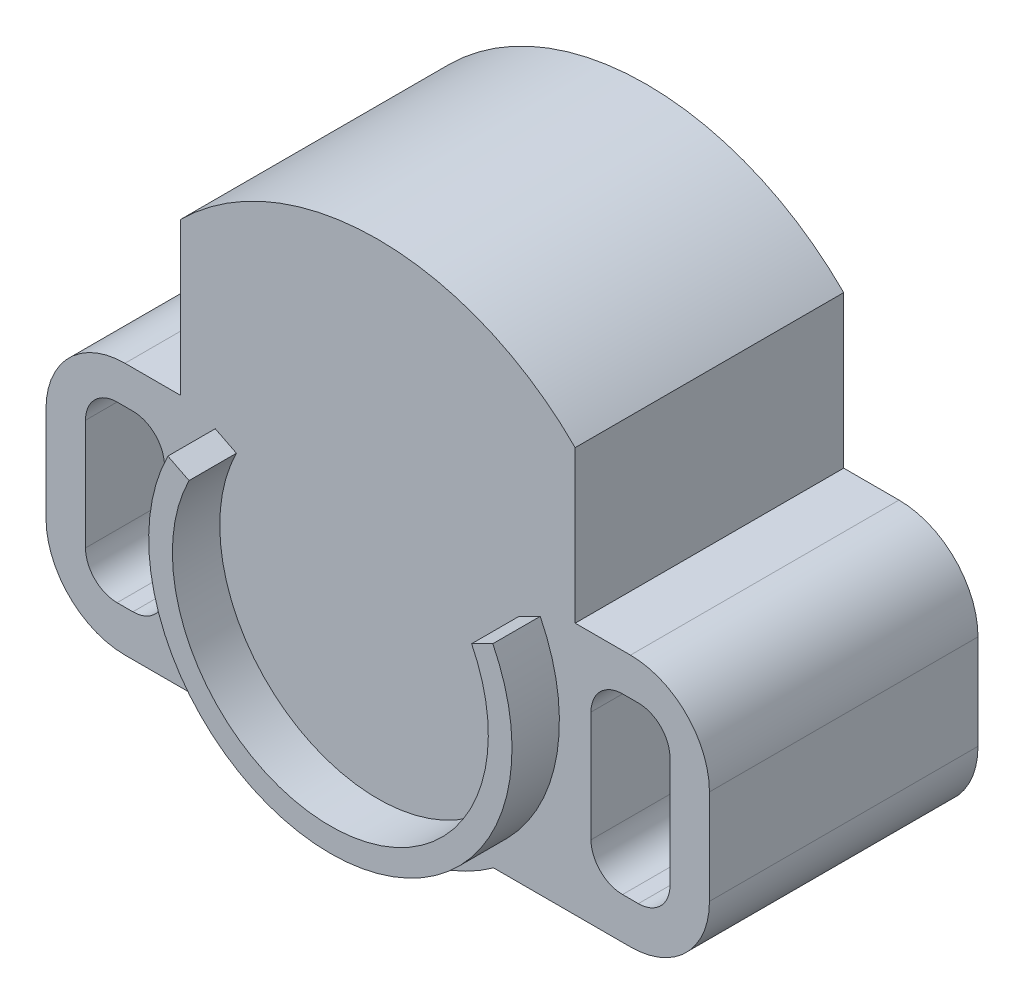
ISO-10303-21;
HEADER;
FILE_DESCRIPTION(('STEP AP214'),'2;1');
FILE_NAME('part.step','',(''),(''),'','','');
FILE_SCHEMA(('AUTOMOTIVE_DESIGN { 1 0 10303 214 1 1 1 1 }'));
ENDSEC;
DATA;
#1=APPLICATION_CONTEXT('core data for automotive mechanical design processes');
#2=APPLICATION_PROTOCOL_DEFINITION('international standard','automotive_design',2000,#1);
#3=PRODUCT_CONTEXT('',#1,'mechanical');
#4=PRODUCT('Part','Part','',(#3));
#5=PRODUCT_RELATED_PRODUCT_CATEGORY('part','',(#4));
#6=PRODUCT_DEFINITION_FORMATION('','',#4);
#7=PRODUCT_DEFINITION_CONTEXT('part definition',#1,'design');
#8=PRODUCT_DEFINITION('design','',#6,#7);
#9=PRODUCT_DEFINITION_SHAPE('','',#8);
#10=(LENGTH_UNIT() NAMED_UNIT(*) SI_UNIT(.MILLI.,.METRE.));
#11=(NAMED_UNIT(*) PLANE_ANGLE_UNIT() SI_UNIT($,.RADIAN.));
#12=(NAMED_UNIT(*) SI_UNIT($,.STERADIAN.) SOLID_ANGLE_UNIT());
#13=UNCERTAINTY_MEASURE_WITH_UNIT(LENGTH_MEASURE(1.E-05),#10,'distance_accuracy_value','');
#14=(GEOMETRIC_REPRESENTATION_CONTEXT(3) GLOBAL_UNCERTAINTY_ASSIGNED_CONTEXT((#13)) GLOBAL_UNIT_ASSIGNED_CONTEXT((#10,
#11,#12)) REPRESENTATION_CONTEXT('',''));
#15=CARTESIAN_POINT('',(0.,0.,0.));
#16=DIRECTION('',(0.,0.,1.));
#17=DIRECTION('',(1.,0.,0.));
#18=AXIS2_PLACEMENT_3D('',#15,#16,#17);
#19=CARTESIAN_POINT('',(0.,0.,17.));
#20=DIRECTION('',(0.,0.,1.));
#21=DIRECTION('',(1.,0.,0.));
#22=AXIS2_PLACEMENT_3D('',#19,#20,#21);
#23=PLANE('',#22);
#24=DIRECTION('',(0.,1.,0.));
#25=VECTOR('',#24,1.);
#26=CARTESIAN_POINT('',(12.5,5.87562803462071,17.));
#27=LINE('',#26,#25);
#28=CARTESIAN_POINT('',(12.5,5.87562803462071,17.));
#29=VERTEX_POINT('',#28);
#30=CARTESIAN_POINT('',(12.5,15.5,17.));
#31=VERTEX_POINT('',#30);
#32=EDGE_CURVE('E444',#29,#31,#27,.T.);
#33=ORIENTED_EDGE('',*,*,#32,.T.);
#34=CARTESIAN_POINT('',(0.,3.,17.));
#35=DIRECTION('',(0.,0.,1.));
#36=DIRECTION('',(-1.,0.,0.));
#37=AXIS2_PLACEMENT_3D('',#34,#35,#36);
#38=CIRCLE('',#37,17.6776695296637);
#39=CARTESIAN_POINT('',(-12.5,15.5,17.));
#40=VERTEX_POINT('',#39);
#41=EDGE_CURVE('E446',#31,#40,#38,.T.);
#42=ORIENTED_EDGE('',*,*,#41,.T.);
#43=DIRECTION('',(0.,-1.,0.));
#44=VECTOR('',#43,1.);
#45=CARTESIAN_POINT('',(-12.5,5.87562803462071,17.));
#46=LINE('',#45,#44);
#47=CARTESIAN_POINT('',(-12.5,5.87562803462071,17.));
#48=VERTEX_POINT('',#47);
#49=EDGE_CURVE('E448',#40,#48,#46,.T.);
#50=ORIENTED_EDGE('',*,*,#49,.T.);
#51=DIRECTION('',(-1.,0.,0.));
#52=VECTOR('',#51,1.);
#53=CARTESIAN_POINT('',(-16.,5.87562803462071,17.));
#54=LINE('',#53,#52);
#55=CARTESIAN_POINT('',(-16.,5.8756280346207,17.));
#56=VERTEX_POINT('',#55);
#57=EDGE_CURVE('E450',#48,#56,#54,.T.);
#58=ORIENTED_EDGE('',*,*,#57,.T.);
#59=CARTESIAN_POINT('',(-16.,0.875628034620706,17.));
#60=DIRECTION('',(0.,0.,1.));
#61=DIRECTION('',(1.,0.,0.));
#62=AXIS2_PLACEMENT_3D('',#59,#60,#61);
#63=CIRCLE('',#62,5.);
#64=CARTESIAN_POINT('',(-21.,0.87562803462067,17.));
#65=VERTEX_POINT('',#64);
#66=EDGE_CURVE('E452',#56,#65,#63,.T.);
#67=ORIENTED_EDGE('',*,*,#66,.T.);
#68=DIRECTION('',(0.,-1.,0.));
#69=VECTOR('',#68,1.);
#70=CARTESIAN_POINT('',(-21.,-5.12437196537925,17.));
#71=LINE('',#70,#69);
#72=CARTESIAN_POINT('',(-21.,-5.12437196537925,17.));
#73=VERTEX_POINT('',#72);
#74=EDGE_CURVE('E454',#65,#73,#71,.T.);
#75=ORIENTED_EDGE('',*,*,#74,.T.);
#76=CARTESIAN_POINT('',(-16.,-5.12437196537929,17.));
#77=DIRECTION('',(0.,0.,1.));
#78=DIRECTION('',(1.,0.,0.));
#79=AXIS2_PLACEMENT_3D('',#76,#77,#78);
#80=CIRCLE('',#79,5.);
#81=CARTESIAN_POINT('',(-16.,-10.1243719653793,17.));
#82=VERTEX_POINT('',#81);
#83=EDGE_CURVE('E456',#73,#82,#80,.T.);
#84=ORIENTED_EDGE('',*,*,#83,.T.);
#85=DIRECTION('',(1.,0.,0.));
#86=VECTOR('',#85,1.);
#87=CARTESIAN_POINT('',(-16.,-10.1243719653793,17.));
#88=LINE('',#87,#86);
#89=CARTESIAN_POINT('',(-7.33124084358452,-10.1243719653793,17.));
#90=VERTEX_POINT('',#89);
#91=EDGE_CURVE('E458',#82,#90,#88,.T.);
#92=ORIENTED_EDGE('',*,*,#91,.T.);
#93=CARTESIAN_POINT('',(0.,0.,17.));
#94=DIRECTION('',(0.,0.,1.));
#95=DIRECTION('',(1.,0.,0.));
#96=AXIS2_PLACEMENT_3D('',#93,#94,#95);
#97=CIRCLE('',#96,12.5);
#98=CARTESIAN_POINT('',(7.33124084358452,-10.1243719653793,17.));
#99=VERTEX_POINT('',#98);
#100=EDGE_CURVE('E431',#90,#99,#97,.T.);
#101=ORIENTED_EDGE('',*,*,#100,.T.);
#102=DIRECTION('',(1.,0.,0.));
#103=VECTOR('',#102,1.);
#104=CARTESIAN_POINT('',(15.9999999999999,-10.1243719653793,17.));
#105=LINE('',#104,#103);
#106=CARTESIAN_POINT('',(15.9999999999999,-10.1243719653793,17.));
#107=VERTEX_POINT('',#106);
#108=EDGE_CURVE('E434',#99,#107,#105,.T.);
#109=ORIENTED_EDGE('',*,*,#108,.T.);
#110=CARTESIAN_POINT('',(16.,-5.12437196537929,17.));
#111=DIRECTION('',(0.,0.,1.));
#112=DIRECTION('',(1.,0.,0.));
#113=AXIS2_PLACEMENT_3D('',#110,#111,#112);
#114=CIRCLE('',#113,5.);
#115=CARTESIAN_POINT('',(21.,-5.12437196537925,17.));
#116=VERTEX_POINT('',#115);
#117=EDGE_CURVE('E436',#107,#116,#114,.T.);
#118=ORIENTED_EDGE('',*,*,#117,.T.);
#119=DIRECTION('',(0.,1.,0.));
#120=VECTOR('',#119,1.);
#121=CARTESIAN_POINT('',(21.,-5.12437196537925,17.));
#122=LINE('',#121,#120);
#123=CARTESIAN_POINT('',(21.,0.875628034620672,17.));
#124=VERTEX_POINT('',#123);
#125=EDGE_CURVE('E438',#116,#124,#122,.T.);
#126=ORIENTED_EDGE('',*,*,#125,.T.);
#127=CARTESIAN_POINT('',(16.,0.875628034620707,17.));
#128=DIRECTION('',(0.,0.,1.));
#129=DIRECTION('',(1.,0.,0.));
#130=AXIS2_PLACEMENT_3D('',#127,#128,#129);
#131=CIRCLE('',#130,5.);
#132=CARTESIAN_POINT('',(15.9999999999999,5.87562803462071,17.));
#133=VERTEX_POINT('',#132);
#134=EDGE_CURVE('E440',#124,#133,#131,.T.);
#135=ORIENTED_EDGE('',*,*,#134,.T.);
#136=DIRECTION('',(-1.,0.,0.));
#137=VECTOR('',#136,1.);
#138=CARTESIAN_POINT('',(12.5,5.87562803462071,17.));
#139=LINE('',#138,#137);
#140=EDGE_CURVE('E442',#133,#29,#139,.T.);
#141=ORIENTED_EDGE('',*,*,#140,.T.);
#142=EDGE_LOOP('',(#33,#42,#50,#58,#67,#75,#84,#92,#101,#109,#118,#126,#135,#141));
#143=FACE_BOUND('',#142,.T.);
#144=DIRECTION('',(0.894427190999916,0.447213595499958,0.));
#145=VECTOR('',#144,1.);
#146=CARTESIAN_POINT('',(0.,0.,17.));
#147=LINE('',#146,#145);
#148=CARTESIAN_POINT('',(8.94427190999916,4.47213595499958,17.));
#149=VERTEX_POINT('',#148);
#150=CARTESIAN_POINT('',(10.285912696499,5.14295634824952,17.));
#151=VERTEX_POINT('',#150);
#152=EDGE_CURVE('E264',#149,#151,#147,.T.);
#153=ORIENTED_EDGE('',*,*,#152,.T.);
#154=CARTESIAN_POINT('',(0.,0.,17.));
#155=DIRECTION('',(0.,0.,1.));
#156=DIRECTION('',(1.,0.,0.));
#157=AXIS2_PLACEMENT_3D('',#154,#155,#156);
#158=CIRCLE('',#157,11.5);
#159=CARTESIAN_POINT('',(-10.285912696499,5.14295634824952,17.));
#160=VERTEX_POINT('',#159);
#161=EDGE_CURVE('E270',#160,#151,#158,.T.);
#162=ORIENTED_EDGE('',*,*,#161,.F.);
#163=DIRECTION('',(0.894427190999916,-0.447213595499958,0.));
#164=VECTOR('',#163,1.);
#165=CARTESIAN_POINT('',(-20.,10.,17.));
#166=LINE('',#165,#164);
#167=CARTESIAN_POINT('',(-8.94427190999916,4.47213595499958,17.));
#168=VERTEX_POINT('',#167);
#169=EDGE_CURVE('E39',#160,#168,#166,.T.);
#170=ORIENTED_EDGE('',*,*,#169,.T.);
#171=CARTESIAN_POINT('',(0.,0.,17.));
#172=DIRECTION('',(0.,0.,1.));
#173=DIRECTION('',(1.,0.,0.));
#174=AXIS2_PLACEMENT_3D('',#171,#172,#173);
#175=CIRCLE('',#174,10.);
#176=EDGE_CURVE('E274',#168,#149,#175,.T.);
#177=ORIENTED_EDGE('',*,*,#176,.T.);
#178=EDGE_LOOP('',(#153,#162,#170,#177));
#179=FACE_BOUND('',#178,.T.);
#180=CARTESIAN_POINT('',(15.5,1.5,17.));
#181=DIRECTION('',(0.,0.,1.));
#182=DIRECTION('',(1.,0.,0.));
#183=AXIS2_PLACEMENT_3D('',#180,#181,#182);
#184=CIRCLE('',#183,2.);
#185=CARTESIAN_POINT('',(15.5,3.5,17.));
#186=VERTEX_POINT('',#185);
#187=CARTESIAN_POINT('',(13.5,1.49999999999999,17.));
#188=VERTEX_POINT('',#187);
#189=EDGE_CURVE('E325',#186,#188,#184,.T.);
#190=ORIENTED_EDGE('',*,*,#189,.F.);
#191=DIRECTION('',(-1.,0.,0.));
#192=VECTOR('',#191,1.);
#193=CARTESIAN_POINT('',(15.5,3.5,17.));
#194=LINE('',#193,#192);
#195=CARTESIAN_POINT('',(16.5,3.5,17.));
#196=VERTEX_POINT('',#195);
#197=EDGE_CURVE('E358',#196,#186,#194,.T.);
#198=ORIENTED_EDGE('',*,*,#197,.F.);
#199=CARTESIAN_POINT('',(16.5,1.5,17.));
#200=DIRECTION('',(0.,0.,1.));
#201=DIRECTION('',(1.,0.,0.));
#202=AXIS2_PLACEMENT_3D('',#199,#200,#201);
#203=CIRCLE('',#202,2.);
#204=CARTESIAN_POINT('',(18.5,1.49999999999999,17.));
#205=VERTEX_POINT('',#204);
#206=EDGE_CURVE('E355',#205,#196,#203,.T.);
#207=ORIENTED_EDGE('',*,*,#206,.F.);
#208=DIRECTION('',(0.,1.,0.));
#209=VECTOR('',#208,1.);
#210=CARTESIAN_POINT('',(18.5,1.49999999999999,17.));
#211=LINE('',#210,#209);
#212=CARTESIAN_POINT('',(18.5,-5.49999999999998,17.));
#213=VERTEX_POINT('',#212);
#214=EDGE_CURVE('E352',#213,#205,#211,.T.);
#215=ORIENTED_EDGE('',*,*,#214,.F.);
#216=CARTESIAN_POINT('',(16.5,-5.5,17.));
#217=DIRECTION('',(0.,0.,1.));
#218=DIRECTION('',(1.,0.,0.));
#219=AXIS2_PLACEMENT_3D('',#216,#217,#218);
#220=CIRCLE('',#219,2.);
#221=CARTESIAN_POINT('',(16.5,-7.5,17.));
#222=VERTEX_POINT('',#221);
#223=EDGE_CURVE('E349',#222,#213,#220,.T.);
#224=ORIENTED_EDGE('',*,*,#223,.F.);
#225=DIRECTION('',(1.,0.,0.));
#226=VECTOR('',#225,1.);
#227=CARTESIAN_POINT('',(15.5,-7.5,17.));
#228=LINE('',#227,#226);
#229=CARTESIAN_POINT('',(15.5,-7.5,17.));
#230=VERTEX_POINT('',#229);
#231=EDGE_CURVE('E346',#230,#222,#228,.T.);
#232=ORIENTED_EDGE('',*,*,#231,.F.);
#233=CARTESIAN_POINT('',(15.5,-5.5,17.));
#234=DIRECTION('',(0.,0.,1.));
#235=DIRECTION('',(1.,0.,0.));
#236=AXIS2_PLACEMENT_3D('',#233,#234,#235);
#237=CIRCLE('',#236,2.);
#238=CARTESIAN_POINT('',(13.5,-5.49999999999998,17.));
#239=VERTEX_POINT('',#238);
#240=EDGE_CURVE('E343',#239,#230,#237,.T.);
#241=ORIENTED_EDGE('',*,*,#240,.F.);
#242=DIRECTION('',(0.,-1.,0.));
#243=VECTOR('',#242,1.);
#244=CARTESIAN_POINT('',(13.5,1.49999999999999,17.));
#245=LINE('',#244,#243);
#246=EDGE_CURVE('E340',#188,#239,#245,.T.);
#247=ORIENTED_EDGE('',*,*,#246,.F.);
#248=EDGE_LOOP('',(#190,#198,#207,#215,#224,#232,#241,#247));
#249=FACE_BOUND('',#248,.T.);
#250=CARTESIAN_POINT('',(-16.5,1.5,17.));
#251=DIRECTION('',(0.,0.,1.));
#252=DIRECTION('',(1.,0.,0.));
#253=AXIS2_PLACEMENT_3D('',#250,#251,#252);
#254=CIRCLE('',#253,2.);
#255=CARTESIAN_POINT('',(-16.5,3.5,17.));
#256=VERTEX_POINT('',#255);
#257=CARTESIAN_POINT('',(-18.5,1.5,17.));
#258=VERTEX_POINT('',#257);
#259=EDGE_CURVE('E47',#256,#258,#254,.T.);
#260=ORIENTED_EDGE('',*,*,#259,.F.);
#261=DIRECTION('',(-1.,0.,0.));
#262=VECTOR('',#261,1.);
#263=CARTESIAN_POINT('',(-16.5,3.5,17.));
#264=LINE('',#263,#262);
#265=CARTESIAN_POINT('',(-15.5,3.5,17.));
#266=VERTEX_POINT('',#265);
#267=EDGE_CURVE('E295',#266,#256,#264,.T.);
#268=ORIENTED_EDGE('',*,*,#267,.F.);
#269=CARTESIAN_POINT('',(-15.5,1.5,17.));
#270=DIRECTION('',(0.,0.,1.));
#271=DIRECTION('',(1.,0.,0.));
#272=AXIS2_PLACEMENT_3D('',#269,#270,#271);
#273=CIRCLE('',#272,2.);
#274=CARTESIAN_POINT('',(-13.5,1.5,17.));
#275=VERTEX_POINT('',#274);
#276=EDGE_CURVE('E292',#275,#266,#273,.T.);
#277=ORIENTED_EDGE('',*,*,#276,.F.);
#278=DIRECTION('',(0.,1.,0.));
#279=VECTOR('',#278,1.);
#280=CARTESIAN_POINT('',(-13.5,1.5,17.));
#281=LINE('',#280,#279);
#282=CARTESIAN_POINT('',(-13.5,-5.5,17.));
#283=VERTEX_POINT('',#282);
#284=EDGE_CURVE('E289',#283,#275,#281,.T.);
#285=ORIENTED_EDGE('',*,*,#284,.F.);
#286=CARTESIAN_POINT('',(-15.5,-5.5,17.));
#287=DIRECTION('',(0.,0.,1.));
#288=DIRECTION('',(1.,0.,0.));
#289=AXIS2_PLACEMENT_3D('',#286,#287,#288);
#290=CIRCLE('',#289,2.);
#291=CARTESIAN_POINT('',(-15.5,-7.5,17.));
#292=VERTEX_POINT('',#291);
#293=EDGE_CURVE('E286',#292,#283,#290,.T.);
#294=ORIENTED_EDGE('',*,*,#293,.F.);
#295=DIRECTION('',(1.,0.,0.));
#296=VECTOR('',#295,1.);
#297=CARTESIAN_POINT('',(-16.5,-7.5,17.));
#298=LINE('',#297,#296);
#299=CARTESIAN_POINT('',(-16.5,-7.5,17.));
#300=VERTEX_POINT('',#299);
#301=EDGE_CURVE('E283',#300,#292,#298,.T.);
#302=ORIENTED_EDGE('',*,*,#301,.F.);
#303=CARTESIAN_POINT('',(-16.5,-5.5,17.));
#304=DIRECTION('',(0.,0.,1.));
#305=DIRECTION('',(1.,0.,0.));
#306=AXIS2_PLACEMENT_3D('',#303,#304,#305);
#307=CIRCLE('',#306,2.);
#308=CARTESIAN_POINT('',(-18.5,-5.5,17.));
#309=VERTEX_POINT('',#308);
#310=EDGE_CURVE('E280',#309,#300,#307,.T.);
#311=ORIENTED_EDGE('',*,*,#310,.F.);
#312=DIRECTION('',(0.,-1.,0.));
#313=VECTOR('',#312,1.);
#314=CARTESIAN_POINT('',(-18.5,1.5,17.));
#315=LINE('',#314,#313);
#316=EDGE_CURVE('E272',#258,#309,#315,.T.);
#317=ORIENTED_EDGE('',*,*,#316,.F.);
#318=EDGE_LOOP('',(#260,#268,#277,#285,#294,#302,#311,#317));
#319=FACE_BOUND('',#318,.T.);
#320=ADVANCED_FACE('F24',(#143,#179,#249,#319),#23,.T.);
#321=CARTESIAN_POINT('',(0.,0.,17.));
#322=DIRECTION('',(0.,0.,-1.));
#323=DIRECTION('',(-1.,0.,0.));
#324=AXIS2_PLACEMENT_3D('',#321,#322,#323);
#325=CYLINDRICAL_SURFACE('',#324,12.5);
#326=CARTESIAN_POINT('',(0.,0.,0.));
#327=DIRECTION('',(0.,0.,1.));
#328=DIRECTION('',(1.,0.,0.));
#329=AXIS2_PLACEMENT_3D('',#326,#327,#328);
#330=CIRCLE('',#329,12.5);
#331=CARTESIAN_POINT('',(-7.33124084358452,-10.1243719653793,0.));
#332=VERTEX_POINT('',#331);
#333=CARTESIAN_POINT('',(7.33124084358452,-10.1243719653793,0.));
#334=VERTEX_POINT('',#333);
#335=EDGE_CURVE('E388',#332,#334,#330,.T.);
#336=ORIENTED_EDGE('',*,*,#335,.T.);
#337=DIRECTION('',(0.,0.,-1.));
#338=VECTOR('',#337,1.);
#339=CARTESIAN_POINT('',(7.33124084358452,-10.1243719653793,17.));
#340=LINE('',#339,#338);
#341=EDGE_CURVE('E11',#99,#334,#340,.T.);
#342=ORIENTED_EDGE('',*,*,#341,.F.);
#343=ORIENTED_EDGE('',*,*,#100,.F.);
#344=DIRECTION('',(0.,0.,-1.));
#345=VECTOR('',#344,1.);
#346=CARTESIAN_POINT('',(-7.33124084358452,-10.1243719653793,17.));
#347=LINE('',#346,#345);
#348=EDGE_CURVE('E460',#90,#332,#347,.T.);
#349=ORIENTED_EDGE('',*,*,#348,.T.);
#350=EDGE_LOOP('',(#336,#342,#343,#349));
#351=FACE_BOUND('',#350,.T.);
#352=ADVANCED_FACE('F26',(#351),#325,.T.);
#353=CARTESIAN_POINT('',(15.9999999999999,-10.1243719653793,17.));
#354=DIRECTION('',(0.,1.,0.));
#355=DIRECTION('',(0.,0.,1.));
#356=AXIS2_PLACEMENT_3D('',#353,#354,#355);
#357=PLANE('',#356);
#358=DIRECTION('',(1.,0.,0.));
#359=VECTOR('',#358,1.);
#360=CARTESIAN_POINT('',(15.9999999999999,-10.1243719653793,0.));
#361=LINE('',#360,#359);
#362=CARTESIAN_POINT('',(15.9999999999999,-10.1243719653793,0.));
#363=VERTEX_POINT('',#362);
#364=EDGE_CURVE('E405',#334,#363,#361,.T.);
#365=ORIENTED_EDGE('',*,*,#364,.T.);
#366=DIRECTION('',(0.,0.,-1.));
#367=VECTOR('',#366,1.);
#368=CARTESIAN_POINT('',(15.9999999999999,-10.1243719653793,17.));
#369=LINE('',#368,#367);
#370=EDGE_CURVE('E32',#107,#363,#369,.T.);
#371=ORIENTED_EDGE('',*,*,#370,.F.);
#372=ORIENTED_EDGE('',*,*,#108,.F.);
#373=ORIENTED_EDGE('',*,*,#341,.T.);
#374=EDGE_LOOP('',(#365,#371,#372,#373));
#375=FACE_BOUND('',#374,.T.);
#376=ADVANCED_FACE('F522',(#375),#357,.F.);
#377=CARTESIAN_POINT('',(16.,-5.12437196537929,17.));
#378=DIRECTION('',(0.,0.,-1.));
#379=DIRECTION('',(-1.,0.,0.));
#380=AXIS2_PLACEMENT_3D('',#377,#378,#379);
#381=CYLINDRICAL_SURFACE('',#380,5.);
#382=CARTESIAN_POINT('',(16.,-5.12437196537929,0.));
#383=DIRECTION('',(0.,0.,1.));
#384=DIRECTION('',(1.,0.,0.));
#385=AXIS2_PLACEMENT_3D('',#382,#383,#384);
#386=CIRCLE('',#385,5.);
#387=CARTESIAN_POINT('',(21.,-5.12437196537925,0.));
#388=VERTEX_POINT('',#387);
#389=EDGE_CURVE('E407',#363,#388,#386,.T.);
#390=ORIENTED_EDGE('',*,*,#389,.T.);
#391=DIRECTION('',(0.,0.,-1.));
#392=VECTOR('',#391,1.);
#393=CARTESIAN_POINT('',(21.,-5.12437196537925,17.));
#394=LINE('',#393,#392);
#395=EDGE_CURVE('E493',#116,#388,#394,.T.);
#396=ORIENTED_EDGE('',*,*,#395,.F.);
#397=ORIENTED_EDGE('',*,*,#117,.F.);
#398=ORIENTED_EDGE('',*,*,#370,.T.);
#399=EDGE_LOOP('',(#390,#396,#397,#398));
#400=FACE_BOUND('',#399,.T.);
#401=ADVANCED_FACE('F500',(#400),#381,.T.);
#402=CARTESIAN_POINT('',(21.,-5.12437196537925,17.));
#403=DIRECTION('',(-1.,0.,0.));
#404=DIRECTION('',(0.,0.,1.));
#405=AXIS2_PLACEMENT_3D('',#402,#403,#404);
#406=PLANE('',#405);
#407=DIRECTION('',(0.,1.,0.));
#408=VECTOR('',#407,1.);
#409=CARTESIAN_POINT('',(21.,-5.12437196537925,0.));
#410=LINE('',#409,#408);
#411=CARTESIAN_POINT('',(21.,0.875628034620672,0.));
#412=VERTEX_POINT('',#411);
#413=EDGE_CURVE('E409',#388,#412,#410,.T.);
#414=ORIENTED_EDGE('',*,*,#413,.T.);
#415=DIRECTION('',(0.,0.,-1.));
#416=VECTOR('',#415,1.);
#417=CARTESIAN_POINT('',(21.,0.875628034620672,17.));
#418=LINE('',#417,#416);
#419=EDGE_CURVE('E490',#124,#412,#418,.T.);
#420=ORIENTED_EDGE('',*,*,#419,.F.);
#421=ORIENTED_EDGE('',*,*,#125,.F.);
#422=ORIENTED_EDGE('',*,*,#395,.T.);
#423=EDGE_LOOP('',(#414,#420,#421,#422));
#424=FACE_BOUND('',#423,.T.);
#425=ADVANCED_FACE('F511',(#424),#406,.F.);
#426=CARTESIAN_POINT('',(16.,0.875628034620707,17.));
#427=DIRECTION('',(0.,0.,-1.));
#428=DIRECTION('',(-1.,0.,0.));
#429=AXIS2_PLACEMENT_3D('',#426,#427,#428);
#430=CYLINDRICAL_SURFACE('',#429,5.);
#431=CARTESIAN_POINT('',(16.,0.875628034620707,0.));
#432=DIRECTION('',(0.,0.,1.));
#433=DIRECTION('',(1.,0.,0.));
#434=AXIS2_PLACEMENT_3D('',#431,#432,#433);
#435=CIRCLE('',#434,5.);
#436=CARTESIAN_POINT('',(15.9999999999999,5.87562803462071,0.));
#437=VERTEX_POINT('',#436);
#438=EDGE_CURVE('E411',#412,#437,#435,.T.);
#439=ORIENTED_EDGE('',*,*,#438,.T.);
#440=DIRECTION('',(0.,0.,-1.));
#441=VECTOR('',#440,1.);
#442=CARTESIAN_POINT('',(15.9999999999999,5.87562803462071,17.));
#443=LINE('',#442,#441);
#444=EDGE_CURVE('E487',#133,#437,#443,.T.);
#445=ORIENTED_EDGE('',*,*,#444,.F.);
#446=ORIENTED_EDGE('',*,*,#134,.F.);
#447=ORIENTED_EDGE('',*,*,#419,.T.);
#448=EDGE_LOOP('',(#439,#445,#446,#447));
#449=FACE_BOUND('',#448,.T.);
#450=ADVANCED_FACE('F515',(#449),#430,.T.);
#451=CARTESIAN_POINT('',(12.5,5.87562803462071,17.));
#452=DIRECTION('',(0.,-1.,0.));
#453=DIRECTION('',(0.,0.,-1.));
#454=AXIS2_PLACEMENT_3D('',#451,#452,#453);
#455=PLANE('',#454);
#456=DIRECTION('',(-1.,0.,0.));
#457=VECTOR('',#456,1.);
#458=CARTESIAN_POINT('',(12.5,5.87562803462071,0.));
#459=LINE('',#458,#457);
#460=CARTESIAN_POINT('',(12.5,5.87562803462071,0.));
#461=VERTEX_POINT('',#460);
#462=EDGE_CURVE('E413',#437,#461,#459,.T.);
#463=ORIENTED_EDGE('',*,*,#462,.T.);
#464=DIRECTION('',(0.,0.,-1.));
#465=VECTOR('',#464,1.);
#466=CARTESIAN_POINT('',(12.5,5.87562803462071,17.));
#467=LINE('',#466,#465);
#468=EDGE_CURVE('E484',#29,#461,#467,.T.);
#469=ORIENTED_EDGE('',*,*,#468,.F.);
#470=ORIENTED_EDGE('',*,*,#140,.F.);
#471=ORIENTED_EDGE('',*,*,#444,.T.);
#472=EDGE_LOOP('',(#463,#469,#470,#471));
#473=FACE_BOUND('',#472,.T.);
#474=ADVANCED_FACE('F565',(#473),#455,.F.);
#475=CARTESIAN_POINT('',(12.5,5.87562803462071,17.));
#476=DIRECTION('',(-1.,0.,0.));
#477=DIRECTION('',(0.,-1.,0.));
#478=AXIS2_PLACEMENT_3D('',#475,#476,#477);
#479=PLANE('',#478);
#480=DIRECTION('',(0.,1.,0.));
#481=VECTOR('',#480,1.);
#482=CARTESIAN_POINT('',(12.5,5.87562803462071,0.));
#483=LINE('',#482,#481);
#484=CARTESIAN_POINT('',(12.5,15.5,0.));
#485=VERTEX_POINT('',#484);
#486=EDGE_CURVE('E415',#461,#485,#483,.T.);
#487=ORIENTED_EDGE('',*,*,#486,.T.);
#488=DIRECTION('',(0.,0.,-1.));
#489=VECTOR('',#488,1.);
#490=CARTESIAN_POINT('',(12.5,15.5,17.));
#491=LINE('',#490,#489);
#492=EDGE_CURVE('E481',#31,#485,#491,.T.);
#493=ORIENTED_EDGE('',*,*,#492,.F.);
#494=ORIENTED_EDGE('',*,*,#32,.F.);
#495=ORIENTED_EDGE('',*,*,#468,.T.);
#496=EDGE_LOOP('',(#487,#493,#494,#495));
#497=FACE_BOUND('',#496,.T.);
#498=ADVANCED_FACE('F563',(#497),#479,.F.);
#499=CARTESIAN_POINT('',(0.,3.,17.));
#500=DIRECTION('',(0.,0.,-1.));
#501=DIRECTION('',(-1.,0.,0.));
#502=AXIS2_PLACEMENT_3D('',#499,#500,#501);
#503=CYLINDRICAL_SURFACE('',#502,17.6776695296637);
#504=CARTESIAN_POINT('',(0.,3.,0.));
#505=DIRECTION('',(0.,0.,1.));
#506=DIRECTION('',(-1.,0.,0.));
#507=AXIS2_PLACEMENT_3D('',#504,#505,#506);
#508=CIRCLE('',#507,17.6776695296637);
#509=CARTESIAN_POINT('',(-12.5,15.5,0.));
#510=VERTEX_POINT('',#509);
#511=EDGE_CURVE('E417',#485,#510,#508,.T.);
#512=ORIENTED_EDGE('',*,*,#511,.T.);
#513=DIRECTION('',(0.,0.,-1.));
#514=VECTOR('',#513,1.);
#515=CARTESIAN_POINT('',(-12.5,15.5,17.));
#516=LINE('',#515,#514);
#517=EDGE_CURVE('E478',#40,#510,#516,.T.);
#518=ORIENTED_EDGE('',*,*,#517,.F.);
#519=ORIENTED_EDGE('',*,*,#41,.F.);
#520=ORIENTED_EDGE('',*,*,#492,.T.);
#521=EDGE_LOOP('',(#512,#518,#519,#520));
#522=FACE_BOUND('',#521,.T.);
#523=ADVANCED_FACE('F558',(#522),#503,.T.);
#524=CARTESIAN_POINT('',(-12.5,5.87562803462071,17.));
#525=DIRECTION('',(1.,0.,0.));
#526=DIRECTION('',(0.,0.,-1.));
#527=AXIS2_PLACEMENT_3D('',#524,#525,#526);
#528=PLANE('',#527);
#529=DIRECTION('',(0.,-1.,0.));
#530=VECTOR('',#529,1.);
#531=CARTESIAN_POINT('',(-12.5,5.87562803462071,0.));
#532=LINE('',#531,#530);
#533=CARTESIAN_POINT('',(-12.5,5.87562803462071,0.));
#534=VERTEX_POINT('',#533);
#535=EDGE_CURVE('E419',#510,#534,#532,.T.);
#536=ORIENTED_EDGE('',*,*,#535,.T.);
#537=DIRECTION('',(0.,0.,-1.));
#538=VECTOR('',#537,1.);
#539=CARTESIAN_POINT('',(-12.5,5.87562803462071,17.));
#540=LINE('',#539,#538);
#541=EDGE_CURVE('E475',#48,#534,#540,.T.);
#542=ORIENTED_EDGE('',*,*,#541,.F.);
#543=ORIENTED_EDGE('',*,*,#49,.F.);
#544=ORIENTED_EDGE('',*,*,#517,.T.);
#545=EDGE_LOOP('',(#536,#542,#543,#544));
#546=FACE_BOUND('',#545,.T.);
#547=ADVANCED_FACE('F553',(#546),#528,.F.);
#548=CARTESIAN_POINT('',(-16.,5.87562803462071,17.));
#549=DIRECTION('',(0.,-1.,0.));
#550=DIRECTION('',(0.,0.,-1.));
#551=AXIS2_PLACEMENT_3D('',#548,#549,#550);
#552=PLANE('',#551);
#553=DIRECTION('',(-1.,0.,0.));
#554=VECTOR('',#553,1.);
#555=CARTESIAN_POINT('',(-16.,5.87562803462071,0.));
#556=LINE('',#555,#554);
#557=CARTESIAN_POINT('',(-16.,5.8756280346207,0.));
#558=VERTEX_POINT('',#557);
#559=EDGE_CURVE('E421',#534,#558,#556,.T.);
#560=ORIENTED_EDGE('',*,*,#559,.T.);
#561=DIRECTION('',(0.,0.,-1.));
#562=VECTOR('',#561,1.);
#563=CARTESIAN_POINT('',(-16.,5.8756280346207,17.));
#564=LINE('',#563,#562);
#565=EDGE_CURVE('E472',#56,#558,#564,.T.);
#566=ORIENTED_EDGE('',*,*,#565,.F.);
#567=ORIENTED_EDGE('',*,*,#57,.F.);
#568=ORIENTED_EDGE('',*,*,#541,.T.);
#569=EDGE_LOOP('',(#560,#566,#567,#568));
#570=FACE_BOUND('',#569,.T.);
#571=ADVANCED_FACE('F549',(#570),#552,.F.);
#572=CARTESIAN_POINT('',(-16.,0.875628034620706,17.));
#573=DIRECTION('',(0.,0.,-1.));
#574=DIRECTION('',(-1.,0.,0.));
#575=AXIS2_PLACEMENT_3D('',#572,#573,#574);
#576=CYLINDRICAL_SURFACE('',#575,5.);
#577=CARTESIAN_POINT('',(-16.,0.875628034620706,0.));
#578=DIRECTION('',(0.,0.,1.));
#579=DIRECTION('',(1.,0.,0.));
#580=AXIS2_PLACEMENT_3D('',#577,#578,#579);
#581=CIRCLE('',#580,5.);
#582=CARTESIAN_POINT('',(-21.,0.87562803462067,0.));
#583=VERTEX_POINT('',#582);
#584=EDGE_CURVE('E423',#558,#583,#581,.T.);
#585=ORIENTED_EDGE('',*,*,#584,.T.);
#586=DIRECTION('',(0.,0.,-1.));
#587=VECTOR('',#586,1.);
#588=CARTESIAN_POINT('',(-21.,0.87562803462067,17.));
#589=LINE('',#588,#587);
#590=EDGE_CURVE('E469',#65,#583,#589,.T.);
#591=ORIENTED_EDGE('',*,*,#590,.F.);
#592=ORIENTED_EDGE('',*,*,#66,.F.);
#593=ORIENTED_EDGE('',*,*,#565,.T.);
#594=EDGE_LOOP('',(#585,#591,#592,#593));
#595=FACE_BOUND('',#594,.T.);
#596=ADVANCED_FACE('F544',(#595),#576,.T.);
#597=CARTESIAN_POINT('',(-21.,-5.12437196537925,17.));
#598=DIRECTION('',(1.,0.,0.));
#599=DIRECTION('',(0.,0.,-1.));
#600=AXIS2_PLACEMENT_3D('',#597,#598,#599);
#601=PLANE('',#600);
#602=DIRECTION('',(0.,-1.,0.));
#603=VECTOR('',#602,1.);
#604=CARTESIAN_POINT('',(-21.,-5.12437196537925,0.));
#605=LINE('',#604,#603);
#606=CARTESIAN_POINT('',(-21.,-5.12437196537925,0.));
#607=VERTEX_POINT('',#606);
#608=EDGE_CURVE('E425',#583,#607,#605,.T.);
#609=ORIENTED_EDGE('',*,*,#608,.T.);
#610=DIRECTION('',(0.,0.,-1.));
#611=VECTOR('',#610,1.);
#612=CARTESIAN_POINT('',(-21.,-5.12437196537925,17.));
#613=LINE('',#612,#611);
#614=EDGE_CURVE('E466',#73,#607,#613,.T.);
#615=ORIENTED_EDGE('',*,*,#614,.F.);
#616=ORIENTED_EDGE('',*,*,#74,.F.);
#617=ORIENTED_EDGE('',*,*,#590,.T.);
#618=EDGE_LOOP('',(#609,#615,#616,#617));
#619=FACE_BOUND('',#618,.T.);
#620=ADVANCED_FACE('F538',(#619),#601,.F.);
#621=CARTESIAN_POINT('',(-16.,-5.12437196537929,17.));
#622=DIRECTION('',(0.,0.,-1.));
#623=DIRECTION('',(-1.,0.,0.));
#624=AXIS2_PLACEMENT_3D('',#621,#622,#623);
#625=CYLINDRICAL_SURFACE('',#624,5.);
#626=CARTESIAN_POINT('',(-16.,-5.12437196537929,0.));
#627=DIRECTION('',(0.,0.,1.));
#628=DIRECTION('',(1.,0.,0.));
#629=AXIS2_PLACEMENT_3D('',#626,#627,#628);
#630=CIRCLE('',#629,5.);
#631=CARTESIAN_POINT('',(-16.,-10.1243719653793,0.));
#632=VERTEX_POINT('',#631);
#633=EDGE_CURVE('E427',#607,#632,#630,.T.);
#634=ORIENTED_EDGE('',*,*,#633,.T.);
#635=DIRECTION('',(0.,0.,-1.));
#636=VECTOR('',#635,1.);
#637=CARTESIAN_POINT('',(-16.,-10.1243719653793,17.));
#638=LINE('',#637,#636);
#639=EDGE_CURVE('E463',#82,#632,#638,.T.);
#640=ORIENTED_EDGE('',*,*,#639,.F.);
#641=ORIENTED_EDGE('',*,*,#83,.F.);
#642=ORIENTED_EDGE('',*,*,#614,.T.);
#643=EDGE_LOOP('',(#634,#640,#641,#642));
#644=FACE_BOUND('',#643,.T.);
#645=ADVANCED_FACE('F534',(#644),#625,.T.);
#646=CARTESIAN_POINT('',(-16.,-10.1243719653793,17.));
#647=DIRECTION('',(0.,1.,0.));
#648=DIRECTION('',(0.,0.,1.));
#649=AXIS2_PLACEMENT_3D('',#646,#647,#648);
#650=PLANE('',#649);
#651=DIRECTION('',(1.,0.,0.));
#652=VECTOR('',#651,1.);
#653=CARTESIAN_POINT('',(-16.,-10.1243719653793,0.));
#654=LINE('',#653,#652);
#655=EDGE_CURVE('E429',#632,#332,#654,.T.);
#656=ORIENTED_EDGE('',*,*,#655,.T.);
#657=ORIENTED_EDGE('',*,*,#348,.F.);
#658=ORIENTED_EDGE('',*,*,#91,.F.);
#659=ORIENTED_EDGE('',*,*,#639,.T.);
#660=EDGE_LOOP('',(#656,#657,#658,#659));
#661=FACE_BOUND('',#660,.T.);
#662=ADVANCED_FACE('F529',(#661),#650,.F.);
#663=CARTESIAN_POINT('',(0.,0.,0.));
#664=DIRECTION('',(0.,0.,1.));
#665=DIRECTION('',(1.,0.,0.));
#666=AXIS2_PLACEMENT_3D('',#663,#664,#665);
#667=PLANE('',#666);
#668=DIRECTION('',(-1.,0.,0.));
#669=VECTOR('',#668,1.);
#670=CARTESIAN_POINT('',(-16.5,3.5,0.));
#671=LINE('',#670,#669);
#672=CARTESIAN_POINT('',(-15.5,3.5,0.));
#673=VERTEX_POINT('',#672);
#674=CARTESIAN_POINT('',(-16.5,3.5,0.));
#675=VERTEX_POINT('',#674);
#676=EDGE_CURVE('E319',#673,#675,#671,.T.);
#677=ORIENTED_EDGE('',*,*,#676,.T.);
#678=CARTESIAN_POINT('',(-16.5,1.5,0.));
#679=DIRECTION('',(0.,0.,1.));
#680=DIRECTION('',(1.,0.,0.));
#681=AXIS2_PLACEMENT_3D('',#678,#679,#680);
#682=CIRCLE('',#681,2.);
#683=CARTESIAN_POINT('',(-18.5,1.5,0.));
#684=VERTEX_POINT('',#683);
#685=EDGE_CURVE('E298',#675,#684,#682,.T.);
#686=ORIENTED_EDGE('',*,*,#685,.T.);
#687=DIRECTION('',(0.,-1.,0.));
#688=VECTOR('',#687,1.);
#689=CARTESIAN_POINT('',(-18.5,1.5,0.));
#690=LINE('',#689,#688);
#691=CARTESIAN_POINT('',(-18.5,-5.5,0.));
#692=VERTEX_POINT('',#691);
#693=EDGE_CURVE('E301',#684,#692,#690,.T.);
#694=ORIENTED_EDGE('',*,*,#693,.T.);
#695=CARTESIAN_POINT('',(-16.5,-5.5,0.));
#696=DIRECTION('',(0.,0.,1.));
#697=DIRECTION('',(1.,0.,0.));
#698=AXIS2_PLACEMENT_3D('',#695,#696,#697);
#699=CIRCLE('',#698,2.);
#700=CARTESIAN_POINT('',(-16.5,-7.5,0.));
#701=VERTEX_POINT('',#700);
#702=EDGE_CURVE('E304',#692,#701,#699,.T.);
#703=ORIENTED_EDGE('',*,*,#702,.T.);
#704=DIRECTION('',(1.,0.,0.));
#705=VECTOR('',#704,1.);
#706=CARTESIAN_POINT('',(-16.5,-7.5,0.));
#707=LINE('',#706,#705);
#708=CARTESIAN_POINT('',(-15.5,-7.5,0.));
#709=VERTEX_POINT('',#708);
#710=EDGE_CURVE('E307',#701,#709,#707,.T.);
#711=ORIENTED_EDGE('',*,*,#710,.T.);
#712=CARTESIAN_POINT('',(-15.5,-5.5,0.));
#713=DIRECTION('',(0.,0.,1.));
#714=DIRECTION('',(1.,0.,0.));
#715=AXIS2_PLACEMENT_3D('',#712,#713,#714);
#716=CIRCLE('',#715,2.);
#717=CARTESIAN_POINT('',(-13.5,-5.5,0.));
#718=VERTEX_POINT('',#717);
#719=EDGE_CURVE('E310',#709,#718,#716,.T.);
#720=ORIENTED_EDGE('',*,*,#719,.T.);
#721=DIRECTION('',(0.,1.,0.));
#722=VECTOR('',#721,1.);
#723=CARTESIAN_POINT('',(-13.5,1.5,0.));
#724=LINE('',#723,#722);
#725=CARTESIAN_POINT('',(-13.5,1.5,0.));
#726=VERTEX_POINT('',#725);
#727=EDGE_CURVE('E313',#718,#726,#724,.T.);
#728=ORIENTED_EDGE('',*,*,#727,.T.);
#729=CARTESIAN_POINT('',(-15.5,1.5,0.));
#730=DIRECTION('',(0.,0.,1.));
#731=DIRECTION('',(1.,0.,0.));
#732=AXIS2_PLACEMENT_3D('',#729,#730,#731);
#733=CIRCLE('',#732,2.);
#734=EDGE_CURVE('E316',#726,#673,#733,.T.);
#735=ORIENTED_EDGE('',*,*,#734,.T.);
#736=EDGE_LOOP('',(#677,#686,#694,#703,#711,#720,#728,#735));
#737=FACE_BOUND('',#736,.T.);
#738=DIRECTION('',(-1.,0.,0.));
#739=VECTOR('',#738,1.);
#740=CARTESIAN_POINT('',(15.5,3.5,0.));
#741=LINE('',#740,#739);
#742=CARTESIAN_POINT('',(16.5,3.5,0.));
#743=VERTEX_POINT('',#742);
#744=CARTESIAN_POINT('',(15.5,3.5,0.));
#745=VERTEX_POINT('',#744);
#746=EDGE_CURVE('E382',#743,#745,#741,.T.);
#747=ORIENTED_EDGE('',*,*,#746,.T.);
#748=CARTESIAN_POINT('',(15.5,1.5,0.));
#749=DIRECTION('',(0.,0.,1.));
#750=DIRECTION('',(1.,0.,0.));
#751=AXIS2_PLACEMENT_3D('',#748,#749,#750);
#752=CIRCLE('',#751,2.);
#753=CARTESIAN_POINT('',(13.5,1.49999999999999,0.));
#754=VERTEX_POINT('',#753);
#755=EDGE_CURVE('E361',#745,#754,#752,.T.);
#756=ORIENTED_EDGE('',*,*,#755,.T.);
#757=DIRECTION('',(0.,-1.,0.));
#758=VECTOR('',#757,1.);
#759=CARTESIAN_POINT('',(13.5,1.49999999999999,0.));
#760=LINE('',#759,#758);
#761=CARTESIAN_POINT('',(13.5,-5.49999999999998,0.));
#762=VERTEX_POINT('',#761);
#763=EDGE_CURVE('E364',#754,#762,#760,.T.);
#764=ORIENTED_EDGE('',*,*,#763,.T.);
#765=CARTESIAN_POINT('',(15.5,-5.5,0.));
#766=DIRECTION('',(0.,0.,1.));
#767=DIRECTION('',(1.,0.,0.));
#768=AXIS2_PLACEMENT_3D('',#765,#766,#767);
#769=CIRCLE('',#768,2.);
#770=CARTESIAN_POINT('',(15.5,-7.5,0.));
#771=VERTEX_POINT('',#770);
#772=EDGE_CURVE('E367',#762,#771,#769,.T.);
#773=ORIENTED_EDGE('',*,*,#772,.T.);
#774=DIRECTION('',(1.,0.,0.));
#775=VECTOR('',#774,1.);
#776=CARTESIAN_POINT('',(15.5,-7.5,0.));
#777=LINE('',#776,#775);
#778=CARTESIAN_POINT('',(16.5,-7.5,0.));
#779=VERTEX_POINT('',#778);
#780=EDGE_CURVE('E370',#771,#779,#777,.T.);
#781=ORIENTED_EDGE('',*,*,#780,.T.);
#782=CARTESIAN_POINT('',(16.5,-5.5,0.));
#783=DIRECTION('',(0.,0.,1.));
#784=DIRECTION('',(1.,0.,0.));
#785=AXIS2_PLACEMENT_3D('',#782,#783,#784);
#786=CIRCLE('',#785,2.);
#787=CARTESIAN_POINT('',(18.5,-5.49999999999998,0.));
#788=VERTEX_POINT('',#787);
#789=EDGE_CURVE('E373',#779,#788,#786,.T.);
#790=ORIENTED_EDGE('',*,*,#789,.T.);
#791=DIRECTION('',(0.,1.,0.));
#792=VECTOR('',#791,1.);
#793=CARTESIAN_POINT('',(18.5,1.49999999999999,0.));
#794=LINE('',#793,#792);
#795=CARTESIAN_POINT('',(18.5,1.49999999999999,0.));
#796=VERTEX_POINT('',#795);
#797=EDGE_CURVE('E376',#788,#796,#794,.T.);
#798=ORIENTED_EDGE('',*,*,#797,.T.);
#799=CARTESIAN_POINT('',(16.5,1.5,0.));
#800=DIRECTION('',(0.,0.,1.));
#801=DIRECTION('',(1.,0.,0.));
#802=AXIS2_PLACEMENT_3D('',#799,#800,#801);
#803=CIRCLE('',#802,2.);
#804=EDGE_CURVE('E379',#796,#743,#803,.T.);
#805=ORIENTED_EDGE('',*,*,#804,.T.);
#806=EDGE_LOOP('',(#747,#756,#764,#773,#781,#790,#798,#805));
#807=FACE_BOUND('',#806,.T.);
#808=ORIENTED_EDGE('',*,*,#335,.F.);
#809=ORIENTED_EDGE('',*,*,#655,.F.);
#810=ORIENTED_EDGE('',*,*,#633,.F.);
#811=ORIENTED_EDGE('',*,*,#608,.F.);
#812=ORIENTED_EDGE('',*,*,#584,.F.);
#813=ORIENTED_EDGE('',*,*,#559,.F.);
#814=ORIENTED_EDGE('',*,*,#535,.F.);
#815=ORIENTED_EDGE('',*,*,#511,.F.);
#816=ORIENTED_EDGE('',*,*,#486,.F.);
#817=ORIENTED_EDGE('',*,*,#462,.F.);
#818=ORIENTED_EDGE('',*,*,#438,.F.);
#819=ORIENTED_EDGE('',*,*,#413,.F.);
#820=ORIENTED_EDGE('',*,*,#389,.F.);
#821=ORIENTED_EDGE('',*,*,#364,.F.);
#822=EDGE_LOOP('',(#808,#809,#810,#811,#812,#813,#814,#815,#816,#817,#818,#819,#820,#821));
#823=FACE_BOUND('',#822,.T.);
#824=ADVANCED_FACE('F506',(#737,#807,#823),#667,.F.);
#825=CARTESIAN_POINT('',(15.5,1.5,0.));
#826=DIRECTION('',(0.,0.,1.));
#827=DIRECTION('',(1.,0.,0.));
#828=AXIS2_PLACEMENT_3D('',#825,#826,#827);
#829=CYLINDRICAL_SURFACE('',#828,2.);
#830=ORIENTED_EDGE('',*,*,#189,.T.);
#831=DIRECTION('',(0.,0.,1.));
#832=VECTOR('',#831,1.);
#833=CARTESIAN_POINT('',(13.5,1.49999999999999,0.));
#834=LINE('',#833,#832);
#835=EDGE_CURVE('E385',#754,#188,#834,.T.);
#836=ORIENTED_EDGE('',*,*,#835,.F.);
#837=ORIENTED_EDGE('',*,*,#755,.F.);
#838=DIRECTION('',(0.,0.,1.));
#839=VECTOR('',#838,1.);
#840=CARTESIAN_POINT('',(15.5,3.5,0.));
#841=LINE('',#840,#839);
#842=EDGE_CURVE('E386',#745,#186,#841,.T.);
#843=ORIENTED_EDGE('',*,*,#842,.T.);
#844=EDGE_LOOP('',(#830,#836,#837,#843));
#845=FACE_BOUND('',#844,.T.);
#846=ADVANCED_FACE('F627',(#845),#829,.F.);
#847=CARTESIAN_POINT('',(15.5,3.5,0.));
#848=DIRECTION('',(0.,1.,0.));
#849=DIRECTION('',(0.,0.,1.));
#850=AXIS2_PLACEMENT_3D('',#847,#848,#849);
#851=PLANE('',#850);
#852=ORIENTED_EDGE('',*,*,#197,.T.);
#853=ORIENTED_EDGE('',*,*,#842,.F.);
#854=ORIENTED_EDGE('',*,*,#746,.F.);
#855=DIRECTION('',(0.,0.,1.));
#856=VECTOR('',#855,1.);
#857=CARTESIAN_POINT('',(16.5,3.5,0.));
#858=LINE('',#857,#856);
#859=EDGE_CURVE('E389',#743,#196,#858,.T.);
#860=ORIENTED_EDGE('',*,*,#859,.T.);
#861=EDGE_LOOP('',(#852,#853,#854,#860));
#862=FACE_BOUND('',#861,.T.);
#863=ADVANCED_FACE('F623',(#862),#851,.F.);
#864=CARTESIAN_POINT('',(16.5,1.5,0.));
#865=DIRECTION('',(0.,0.,1.));
#866=DIRECTION('',(1.,0.,0.));
#867=AXIS2_PLACEMENT_3D('',#864,#865,#866);
#868=CYLINDRICAL_SURFACE('',#867,2.);
#869=ORIENTED_EDGE('',*,*,#206,.T.);
#870=ORIENTED_EDGE('',*,*,#859,.F.);
#871=ORIENTED_EDGE('',*,*,#804,.F.);
#872=DIRECTION('',(0.,0.,1.));
#873=VECTOR('',#872,1.);
#874=CARTESIAN_POINT('',(18.5,1.49999999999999,0.));
#875=LINE('',#874,#873);
#876=EDGE_CURVE('E391',#796,#205,#875,.T.);
#877=ORIENTED_EDGE('',*,*,#876,.T.);
#878=EDGE_LOOP('',(#869,#870,#871,#877));
#879=FACE_BOUND('',#878,.T.);
#880=ADVANCED_FACE('F626',(#879),#868,.F.);
#881=CARTESIAN_POINT('',(18.5,1.49999999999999,0.));
#882=DIRECTION('',(1.,0.,0.));
#883=DIRECTION('',(0.,0.,-1.));
#884=AXIS2_PLACEMENT_3D('',#881,#882,#883);
#885=PLANE('',#884);
#886=ORIENTED_EDGE('',*,*,#214,.T.);
#887=ORIENTED_EDGE('',*,*,#876,.F.);
#888=ORIENTED_EDGE('',*,*,#797,.F.);
#889=DIRECTION('',(0.,0.,1.));
#890=VECTOR('',#889,1.);
#891=CARTESIAN_POINT('',(18.5,-5.49999999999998,0.));
#892=LINE('',#891,#890);
#893=EDGE_CURVE('E393',#788,#213,#892,.T.);
#894=ORIENTED_EDGE('',*,*,#893,.T.);
#895=EDGE_LOOP('',(#886,#887,#888,#894));
#896=FACE_BOUND('',#895,.T.);
#897=ADVANCED_FACE('F631',(#896),#885,.F.);
#898=CARTESIAN_POINT('',(16.5,-5.5,0.));
#899=DIRECTION('',(0.,0.,1.));
#900=DIRECTION('',(1.,0.,0.));
#901=AXIS2_PLACEMENT_3D('',#898,#899,#900);
#902=CYLINDRICAL_SURFACE('',#901,2.);
#903=ORIENTED_EDGE('',*,*,#223,.T.);
#904=ORIENTED_EDGE('',*,*,#893,.F.);
#905=ORIENTED_EDGE('',*,*,#789,.F.);
#906=DIRECTION('',(0.,0.,1.));
#907=VECTOR('',#906,1.);
#908=CARTESIAN_POINT('',(16.5,-7.5,0.));
#909=LINE('',#908,#907);
#910=EDGE_CURVE('E395',#779,#222,#909,.T.);
#911=ORIENTED_EDGE('',*,*,#910,.T.);
#912=EDGE_LOOP('',(#903,#904,#905,#911));
#913=FACE_BOUND('',#912,.T.);
#914=ADVANCED_FACE('F635',(#913),#902,.F.);
#915=CARTESIAN_POINT('',(15.5,-7.5,0.));
#916=DIRECTION('',(0.,-1.,0.));
#917=DIRECTION('',(0.,0.,-1.));
#918=AXIS2_PLACEMENT_3D('',#915,#916,#917);
#919=PLANE('',#918);
#920=ORIENTED_EDGE('',*,*,#231,.T.);
#921=ORIENTED_EDGE('',*,*,#910,.F.);
#922=ORIENTED_EDGE('',*,*,#780,.F.);
#923=DIRECTION('',(0.,0.,1.));
#924=VECTOR('',#923,1.);
#925=CARTESIAN_POINT('',(15.5,-7.5,0.));
#926=LINE('',#925,#924);
#927=EDGE_CURVE('E397',#771,#230,#926,.T.);
#928=ORIENTED_EDGE('',*,*,#927,.T.);
#929=EDGE_LOOP('',(#920,#921,#922,#928));
#930=FACE_BOUND('',#929,.T.);
#931=ADVANCED_FACE('F639',(#930),#919,.F.);
#932=CARTESIAN_POINT('',(15.5,-5.5,0.));
#933=DIRECTION('',(0.,0.,1.));
#934=DIRECTION('',(1.,0.,0.));
#935=AXIS2_PLACEMENT_3D('',#932,#933,#934);
#936=CYLINDRICAL_SURFACE('',#935,2.);
#937=ORIENTED_EDGE('',*,*,#240,.T.);
#938=ORIENTED_EDGE('',*,*,#927,.F.);
#939=ORIENTED_EDGE('',*,*,#772,.F.);
#940=DIRECTION('',(0.,0.,1.));
#941=VECTOR('',#940,1.);
#942=CARTESIAN_POINT('',(13.5,-5.49999999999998,0.));
#943=LINE('',#942,#941);
#944=EDGE_CURVE('E399',#762,#239,#943,.T.);
#945=ORIENTED_EDGE('',*,*,#944,.T.);
#946=EDGE_LOOP('',(#937,#938,#939,#945));
#947=FACE_BOUND('',#946,.T.);
#948=ADVANCED_FACE('F643',(#947),#936,.F.);
#949=CARTESIAN_POINT('',(13.5,1.49999999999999,0.));
#950=DIRECTION('',(-1.,0.,0.));
#951=DIRECTION('',(0.,0.,1.));
#952=AXIS2_PLACEMENT_3D('',#949,#950,#951);
#953=PLANE('',#952);
#954=ORIENTED_EDGE('',*,*,#246,.T.);
#955=ORIENTED_EDGE('',*,*,#944,.F.);
#956=ORIENTED_EDGE('',*,*,#763,.F.);
#957=ORIENTED_EDGE('',*,*,#835,.T.);
#958=EDGE_LOOP('',(#954,#955,#956,#957));
#959=FACE_BOUND('',#958,.T.);
#960=ADVANCED_FACE('F622',(#959),#953,.F.);
#961=CARTESIAN_POINT('',(-16.5,1.5,0.));
#962=DIRECTION('',(0.,0.,1.));
#963=DIRECTION('',(1.,0.,0.));
#964=AXIS2_PLACEMENT_3D('',#961,#962,#963);
#965=CYLINDRICAL_SURFACE('',#964,2.);
#966=ORIENTED_EDGE('',*,*,#259,.T.);
#967=DIRECTION('',(0.,0.,1.));
#968=VECTOR('',#967,1.);
#969=CARTESIAN_POINT('',(-18.5,1.5,0.));
#970=LINE('',#969,#968);
#971=EDGE_CURVE('E322',#684,#258,#970,.T.);
#972=ORIENTED_EDGE('',*,*,#971,.F.);
#973=ORIENTED_EDGE('',*,*,#685,.F.);
#974=DIRECTION('',(0.,0.,1.));
#975=VECTOR('',#974,1.);
#976=CARTESIAN_POINT('',(-16.5,3.5,0.));
#977=LINE('',#976,#975);
#978=EDGE_CURVE('E323',#675,#256,#977,.T.);
#979=ORIENTED_EDGE('',*,*,#978,.T.);
#980=EDGE_LOOP('',(#966,#972,#973,#979));
#981=FACE_BOUND('',#980,.T.);
#982=ADVANCED_FACE('F596',(#981),#965,.F.);
#983=CARTESIAN_POINT('',(-16.5,3.5,0.));
#984=DIRECTION('',(0.,1.,0.));
#985=DIRECTION('',(0.,0.,1.));
#986=AXIS2_PLACEMENT_3D('',#983,#984,#985);
#987=PLANE('',#986);
#988=ORIENTED_EDGE('',*,*,#267,.T.);
#989=ORIENTED_EDGE('',*,*,#978,.F.);
#990=ORIENTED_EDGE('',*,*,#676,.F.);
#991=DIRECTION('',(0.,0.,1.));
#992=VECTOR('',#991,1.);
#993=CARTESIAN_POINT('',(-15.5,3.5,0.));
#994=LINE('',#993,#992);
#995=EDGE_CURVE('E326',#673,#266,#994,.T.);
#996=ORIENTED_EDGE('',*,*,#995,.T.);
#997=EDGE_LOOP('',(#988,#989,#990,#996));
#998=FACE_BOUND('',#997,.T.);
#999=ADVANCED_FACE('F592',(#998),#987,.F.);
#1000=CARTESIAN_POINT('',(-15.5,1.5,0.));
#1001=DIRECTION('',(0.,0.,1.));
#1002=DIRECTION('',(1.,0.,0.));
#1003=AXIS2_PLACEMENT_3D('',#1000,#1001,#1002);
#1004=CYLINDRICAL_SURFACE('',#1003,2.);
#1005=ORIENTED_EDGE('',*,*,#276,.T.);
#1006=ORIENTED_EDGE('',*,*,#995,.F.);
#1007=ORIENTED_EDGE('',*,*,#734,.F.);
#1008=DIRECTION('',(0.,0.,1.));
#1009=VECTOR('',#1008,1.);
#1010=CARTESIAN_POINT('',(-13.5,1.5,0.));
#1011=LINE('',#1010,#1009);
#1012=EDGE_CURVE('E328',#726,#275,#1011,.T.);
#1013=ORIENTED_EDGE('',*,*,#1012,.T.);
#1014=EDGE_LOOP('',(#1005,#1006,#1007,#1013));
#1015=FACE_BOUND('',#1014,.T.);
#1016=ADVANCED_FACE('F595',(#1015),#1004,.F.);
#1017=CARTESIAN_POINT('',(-13.5,1.5,0.));
#1018=DIRECTION('',(1.,0.,0.));
#1019=DIRECTION('',(0.,0.,-1.));
#1020=AXIS2_PLACEMENT_3D('',#1017,#1018,#1019);
#1021=PLANE('',#1020);
#1022=ORIENTED_EDGE('',*,*,#284,.T.);
#1023=ORIENTED_EDGE('',*,*,#1012,.F.);
#1024=ORIENTED_EDGE('',*,*,#727,.F.);
#1025=DIRECTION('',(0.,0.,1.));
#1026=VECTOR('',#1025,1.);
#1027=CARTESIAN_POINT('',(-13.5,-5.5,0.));
#1028=LINE('',#1027,#1026);
#1029=EDGE_CURVE('E330',#718,#283,#1028,.T.);
#1030=ORIENTED_EDGE('',*,*,#1029,.T.);
#1031=EDGE_LOOP('',(#1022,#1023,#1024,#1030));
#1032=FACE_BOUND('',#1031,.T.);
#1033=ADVANCED_FACE('F600',(#1032),#1021,.F.);
#1034=CARTESIAN_POINT('',(-15.5,-5.5,0.));
#1035=DIRECTION('',(0.,0.,1.));
#1036=DIRECTION('',(1.,0.,0.));
#1037=AXIS2_PLACEMENT_3D('',#1034,#1035,#1036);
#1038=CYLINDRICAL_SURFACE('',#1037,2.);
#1039=ORIENTED_EDGE('',*,*,#293,.T.);
#1040=ORIENTED_EDGE('',*,*,#1029,.F.);
#1041=ORIENTED_EDGE('',*,*,#719,.F.);
#1042=DIRECTION('',(0.,0.,1.));
#1043=VECTOR('',#1042,1.);
#1044=CARTESIAN_POINT('',(-15.5,-7.5,0.));
#1045=LINE('',#1044,#1043);
#1046=EDGE_CURVE('E332',#709,#292,#1045,.T.);
#1047=ORIENTED_EDGE('',*,*,#1046,.T.);
#1048=EDGE_LOOP('',(#1039,#1040,#1041,#1047));
#1049=FACE_BOUND('',#1048,.T.);
#1050=ADVANCED_FACE('F604',(#1049),#1038,.F.);
#1051=CARTESIAN_POINT('',(-16.5,-7.5,0.));
#1052=DIRECTION('',(0.,-1.,0.));
#1053=DIRECTION('',(0.,0.,-1.));
#1054=AXIS2_PLACEMENT_3D('',#1051,#1052,#1053);
#1055=PLANE('',#1054);
#1056=ORIENTED_EDGE('',*,*,#301,.T.);
#1057=ORIENTED_EDGE('',*,*,#1046,.F.);
#1058=ORIENTED_EDGE('',*,*,#710,.F.);
#1059=DIRECTION('',(0.,0.,1.));
#1060=VECTOR('',#1059,1.);
#1061=CARTESIAN_POINT('',(-16.5,-7.5,0.));
#1062=LINE('',#1061,#1060);
#1063=EDGE_CURVE('E334',#701,#300,#1062,.T.);
#1064=ORIENTED_EDGE('',*,*,#1063,.T.);
#1065=EDGE_LOOP('',(#1056,#1057,#1058,#1064));
#1066=FACE_BOUND('',#1065,.T.);
#1067=ADVANCED_FACE('F608',(#1066),#1055,.F.);
#1068=CARTESIAN_POINT('',(-16.5,-5.5,0.));
#1069=DIRECTION('',(0.,0.,1.));
#1070=DIRECTION('',(1.,0.,0.));
#1071=AXIS2_PLACEMENT_3D('',#1068,#1069,#1070);
#1072=CYLINDRICAL_SURFACE('',#1071,2.);
#1073=ORIENTED_EDGE('',*,*,#310,.T.);
#1074=ORIENTED_EDGE('',*,*,#1063,.F.);
#1075=ORIENTED_EDGE('',*,*,#702,.F.);
#1076=DIRECTION('',(0.,0.,1.));
#1077=VECTOR('',#1076,1.);
#1078=CARTESIAN_POINT('',(-18.5,-5.5,0.));
#1079=LINE('',#1078,#1077);
#1080=EDGE_CURVE('E336',#692,#309,#1079,.T.);
#1081=ORIENTED_EDGE('',*,*,#1080,.T.);
#1082=EDGE_LOOP('',(#1073,#1074,#1075,#1081));
#1083=FACE_BOUND('',#1082,.T.);
#1084=ADVANCED_FACE('F612',(#1083),#1072,.F.);
#1085=CARTESIAN_POINT('',(-18.5,1.5,0.));
#1086=DIRECTION('',(-1.,0.,0.));
#1087=DIRECTION('',(0.,0.,1.));
#1088=AXIS2_PLACEMENT_3D('',#1085,#1086,#1087);
#1089=PLANE('',#1088);
#1090=ORIENTED_EDGE('',*,*,#316,.T.);
#1091=ORIENTED_EDGE('',*,*,#1080,.F.);
#1092=ORIENTED_EDGE('',*,*,#693,.F.);
#1093=ORIENTED_EDGE('',*,*,#971,.T.);
#1094=EDGE_LOOP('',(#1090,#1091,#1092,#1093));
#1095=FACE_BOUND('',#1094,.T.);
#1096=ADVANCED_FACE('F591',(#1095),#1089,.F.);
#1097=CARTESIAN_POINT('',(0.,0.,20.));
#1098=DIRECTION('',(0.,0.,-1.));
#1099=DIRECTION('',(-1.,0.,0.));
#1100=AXIS2_PLACEMENT_3D('',#1097,#1098,#1099);
#1101=CYLINDRICAL_SURFACE('',#1100,11.5);
#1102=ORIENTED_EDGE('',*,*,#161,.T.);
#1103=DIRECTION('',(0.,0.,-1.));
#1104=VECTOR('',#1103,1.);
#1105=CARTESIAN_POINT('',(10.285912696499,5.14295634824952,20.));
#1106=LINE('',#1105,#1104);
#1107=CARTESIAN_POINT('',(10.285912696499,5.14295634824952,20.));
#1108=VERTEX_POINT('',#1107);
#1109=EDGE_CURVE('E269',#151,#1108,#1106,.F.);
#1110=ORIENTED_EDGE('',*,*,#1109,.T.);
#1111=CARTESIAN_POINT('',(0.,0.,20.));
#1112=DIRECTION('',(0.,0.,1.));
#1113=DIRECTION('',(1.,0.,0.));
#1114=AXIS2_PLACEMENT_3D('',#1111,#1112,#1113);
#1115=CIRCLE('',#1114,11.5);
#1116=CARTESIAN_POINT('',(-10.285912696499,5.14295634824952,20.));
#1117=VERTEX_POINT('',#1116);
#1118=EDGE_CURVE('E261',#1117,#1108,#1115,.T.);
#1119=ORIENTED_EDGE('',*,*,#1118,.F.);
#1120=DIRECTION('',(0.,0.,-1.));
#1121=VECTOR('',#1120,1.);
#1122=CARTESIAN_POINT('',(-10.285912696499,5.14295634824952,20.));
#1123=LINE('',#1122,#1121);
#1124=EDGE_CURVE('E245',#1117,#160,#1123,.T.);
#1125=ORIENTED_EDGE('',*,*,#1124,.T.);
#1126=EDGE_LOOP('',(#1102,#1110,#1119,#1125));
#1127=FACE_BOUND('',#1126,.T.);
#1128=ADVANCED_FACE('F268',(#1127),#1101,.T.);
#1129=CARTESIAN_POINT('',(0.,0.,20.));
#1130=DIRECTION('',(0.,0.,1.));
#1131=DIRECTION('',(1.,0.,0.));
#1132=AXIS2_PLACEMENT_3D('',#1129,#1130,#1131);
#1133=PLANE('',#1132);
#1134=DIRECTION('',(0.894427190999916,0.447213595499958,0.));
#1135=VECTOR('',#1134,1.);
#1136=CARTESIAN_POINT('',(0.,0.,20.));
#1137=LINE('',#1136,#1135);
#1138=CARTESIAN_POINT('',(8.94427190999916,4.47213595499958,20.));
#1139=VERTEX_POINT('',#1138);
#1140=EDGE_CURVE('E265',#1139,#1108,#1137,.T.);
#1141=ORIENTED_EDGE('',*,*,#1140,.F.);
#1142=CARTESIAN_POINT('',(0.,0.,20.));
#1143=DIRECTION('',(0.,0.,1.));
#1144=DIRECTION('',(1.,0.,0.));
#1145=AXIS2_PLACEMENT_3D('',#1142,#1143,#1144);
#1146=CIRCLE('',#1145,10.);
#1147=CARTESIAN_POINT('',(-8.94427190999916,4.47213595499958,20.));
#1148=VERTEX_POINT('',#1147);
#1149=EDGE_CURVE('E263',#1148,#1139,#1146,.T.);
#1150=ORIENTED_EDGE('',*,*,#1149,.F.);
#1151=DIRECTION('',(0.894427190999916,-0.447213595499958,0.));
#1152=VECTOR('',#1151,1.);
#1153=CARTESIAN_POINT('',(-20.,10.,20.));
#1154=LINE('',#1153,#1152);
#1155=EDGE_CURVE('E248',#1117,#1148,#1154,.T.);
#1156=ORIENTED_EDGE('',*,*,#1155,.F.);
#1157=ORIENTED_EDGE('',*,*,#1118,.T.);
#1158=EDGE_LOOP('',(#1141,#1150,#1156,#1157));
#1159=FACE_BOUND('',#1158,.T.);
#1160=ADVANCED_FACE('F260',(#1159),#1133,.T.);
#1161=CARTESIAN_POINT('',(0.,0.,17.));
#1162=DIRECTION('',(0.,0.,1.));
#1163=DIRECTION('',(1.,0.,0.));
#1164=AXIS2_PLACEMENT_3D('',#1161,#1162,#1163);
#1165=CYLINDRICAL_SURFACE('',#1164,10.);
#1166=ORIENTED_EDGE('',*,*,#1149,.T.);
#1167=DIRECTION('',(0.,0.,1.));
#1168=VECTOR('',#1167,1.);
#1169=CARTESIAN_POINT('',(8.94427190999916,4.47213595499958,17.));
#1170=LINE('',#1169,#1168);
#1171=EDGE_CURVE('E253',#1139,#149,#1170,.F.);
#1172=ORIENTED_EDGE('',*,*,#1171,.T.);
#1173=ORIENTED_EDGE('',*,*,#176,.F.);
#1174=DIRECTION('',(0.,0.,1.));
#1175=VECTOR('',#1174,1.);
#1176=CARTESIAN_POINT('',(-8.94427190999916,4.47213595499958,17.));
#1177=LINE('',#1176,#1175);
#1178=EDGE_CURVE('E254',#168,#1148,#1177,.T.);
#1179=ORIENTED_EDGE('',*,*,#1178,.T.);
#1180=EDGE_LOOP('',(#1166,#1172,#1173,#1179));
#1181=FACE_BOUND('',#1180,.T.);
#1182=ADVANCED_FACE('F583',(#1181),#1165,.F.);
#1183=CARTESIAN_POINT('',(0.,0.,17.));
#1184=DIRECTION('',(0.447213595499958,-0.894427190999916,0.));
#1185=DIRECTION('',(0.894427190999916,0.447213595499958,0.));
#1186=AXIS2_PLACEMENT_3D('',#1183,#1184,#1185);
#1187=PLANE('',#1186);
#1188=ORIENTED_EDGE('',*,*,#152,.F.);
#1189=ORIENTED_EDGE('',*,*,#1171,.F.);
#1190=ORIENTED_EDGE('',*,*,#1140,.T.);
#1191=ORIENTED_EDGE('',*,*,#1109,.F.);
#1192=EDGE_LOOP('',(#1188,#1189,#1190,#1191));
#1193=FACE_BOUND('',#1192,.T.);
#1194=ADVANCED_FACE('F581',(#1193),#1187,.F.);
#1195=CARTESIAN_POINT('',(-20.,10.,17.));
#1196=DIRECTION('',(-0.447213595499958,-0.894427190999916,0.));
#1197=DIRECTION('',(0.894427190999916,-0.447213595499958,0.));
#1198=AXIS2_PLACEMENT_3D('',#1195,#1196,#1197);
#1199=PLANE('',#1198);
#1200=ORIENTED_EDGE('',*,*,#1155,.T.);
#1201=ORIENTED_EDGE('',*,*,#1178,.F.);
#1202=ORIENTED_EDGE('',*,*,#169,.F.);
#1203=ORIENTED_EDGE('',*,*,#1124,.F.);
#1204=EDGE_LOOP('',(#1200,#1201,#1202,#1203));
#1205=FACE_BOUND('',#1204,.T.);
#1206=ADVANCED_FACE('F247',(#1205),#1199,.F.);
#1207=CLOSED_SHELL('',(#320,#352,#376,#401,#425,#450,#474,#498,#523,#547,#571,#596,#620,#645,
#662,#824,#846,#863,#880,#897,#914,#931,#948,#960,#982,#999,#1016,#1033,#1050,#1067,#1084,#1096,
#1128,#1160,#1182,#1194,#1206));
#1208=MANIFOLD_SOLID_BREP('B2',#1207);
#1209=ADVANCED_BREP_SHAPE_REPRESENTATION('',(#18,#1208),#14);
#1210=SHAPE_DEFINITION_REPRESENTATION(#9,#1209);
ENDSEC;
END-ISO-10303-21;
